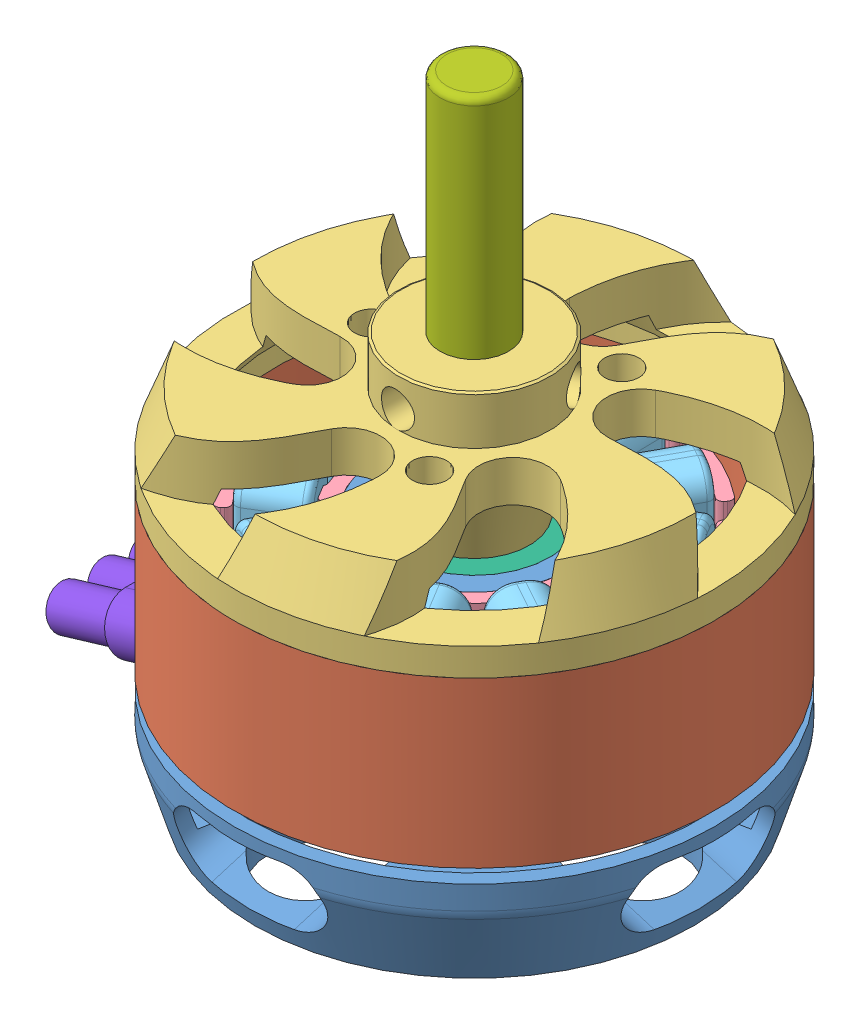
SolidWorks assembly Turnigy Motor.SLDASM, configuration Default (file format 8000). Lengths in mm.
Overall size (45.77 47.68 37.01).
19 component instances, 8 part files, 15 mates.
Components (placement in the parent):
- Bottom Shell-1: Bottom Shell.SLDPRT [Default] at (12.4509 15.3933 26.7626) size (35 18 35)
- Middle Shell-1: Middle Shell.SLDPRT [Default] at (12.4509 23.3933 26.7626) x (-0.059134 0 0.99825) z (-0.99825 0 -0.059134) size (35 12 35)
- Top Shell-1: Top Shell.SLDPRT [Default] at (12.4509 35.3933 26.7626) x (0.999258 0 0.038512) z (-0.038512 0 0.999258) size (35 11.5 35)
- Inner Coil Rack-1: Inner Coil Rack.SLDPRT [Default] at (12.4509 25.3933 26.7626) x (0.999766 0 -0.021621) z (0.021621 0 0.999766) size (27 8 27)
- Coil-1: Coil.SLDPRT [Default] at (12.1274 25.3933 34.9312) x (0.999766 0 -0.021621) z (0.021621 0 0.999766) size (4 11 4.25)
- Coil-13: Coil.SLDPRT [Default] at (8.0864 25.3933 33.675) x (0.876633 0 0.481159) z (-0.481159 0 0.876633) size (4 11 4.25)
- Coil-14: Coil.SLDPRT [Default] at (5.2149 25.3933 30.5667) x (0.518607 0 0.855013) z (-0.855013 0 0.518607) size (4 11 4.25)
- Coil-15: Coil.SLDPRT [Default] at (4.2823 25.3933 26.4391) x (0.021621 0 0.999766) z (-0.999766 0 0.021621) size (4 11 4.25)
- Coil-16: Coil.SLDPRT [Default] at (5.5384 25.3933 22.3982) x (-0.481159 0 0.876633) z (-0.876633 0 -0.481159) size (4 11 4.25)
- Coil-17: Coil.SLDPRT [Default] at (8.6467 25.3933 19.5266) x (-0.855013 0 0.518607) z (-0.518607 0 -0.855013) size (4 11 4.25)
- Coil-18: Coil.SLDPRT [Default] at (12.7743 25.3933 18.594) x (-0.999766 0 0.021621) z (-0.021621 0 -0.999766) size (4 11 4.25)
- Coil-19: Coil.SLDPRT [Default] at (16.8153 25.3933 19.8501) x (-0.876633 0 -0.481159) z (0.481159 0 -0.876633) size (4 11 4.25)
- Coil-20: Coil.SLDPRT [Default] at (19.6868 25.3933 22.9584) x (-0.518607 0 -0.855013) z (0.855013 0 -0.518607) size (4 11 4.25)
- Coil-21: Coil.SLDPRT [Default] at (20.6194 25.3933 27.086) x (-0.021621 0 -0.999766) z (0.999766 0 -0.021621) size (4 11 4.25)
- Coil-22: Coil.SLDPRT [Default] at (19.3633 25.3933 31.127) x (0.481159 0 -0.876633) z (0.876633 0 0.481159) size (4 11 4.25)
- Coil-23: Coil.SLDPRT [Default] at (16.255 25.3933 33.9985) x (0.855013 0 -0.518607) z (0.518607 0 0.855013) size (4 11 4.25)
- Inner Bearing-1: Inner Bearing.SLDPRT [Default] at (12.4509 15.3933 26.7626) size (11 18 11)
- Shaft-1: Shaft.SLDPRT [Default] at (12.4509 13.8933 26.7626) size (5 47.5 5)
- Wires-2: Wires.SLDPRT [Default] at (1.5152 18.792 22.2251) x (0 0 1) z (-0.957822 -0.287361 0) size (10 4 16)
Mates (geometry in assembly coordinates):
- Concentric1: concentric aligned: cylinder of Bottom Shell-1 through (12.4509 22.3933 26.7626) axis (0 -1 0) radius 17.5001; cylinder of Middle Shell-1 through (12.4509 35.3933 26.7626) axis (0 -1 0) radius 17.5
- Distance1: distance = 1 mm anti-aligned: plane of Bottom Shell-1 through (12.4509 22.3933 26.7626) normal (0 1 0); plane of Middle Shell-1 through (12.4509 23.3933 26.7626) normal (0 -1 0)
- Concentric2: concentric aligned: cylinder of Middle Shell-1 through (12.4509 35.3933 26.7626) axis (0 -1 0) radius 17.5; cylinder of Top Shell-1 through (12.4509 37.3933 26.7626) axis (0 -1 0) radius 17.5
- Coincident2: coincident anti-aligned: plane of Middle Shell-1 through (12.4509 35.3933 26.7626) normal (0 1 0); plane of Top Shell-1 through (12.4509 35.3933 26.7626) normal (0 -1 0)
- Coincident3: coincident anti-aligned: plane of Inner Coil Rack-1 through (12.1178 17.6487 34.4885) normal (-0.999766 0 0.021621); plane of Coil-1 through (12.2193 25.3933 39.1802) normal (0.999766 0 -0.021621)
- Coincident4: coincident anti-aligned: plane of Inner Coil Rack-1 through (12.4509 33.3933 26.7626) normal (0 1 0); plane of Coil-1 through (12.2193 33.3933 39.1802) normal (0 -1 0)
- Coincident6: coincident: cylinder of Inner Coil Rack-1 through (12.4509 17.6487 26.7626) axis (0 1 0) radius 12.5; line of Coil-1 through (14.2188 25.6433 39.1369) axis (0 1 0)
- Concentric5: concentric aligned: cylinder of Middle Shell-1 through (12.4509 35.3933 26.7626) axis (0 -1 0) radius 17.5; cylinder of Inner Coil Rack-1 through (12.4509 33.3933 26.7626) axis (0 -1 0) radius 7
- Coincident7: coincident anti-aligned: plane of Top Shell-1 through (12.4509 33.3933 26.7626) normal (0 -1 0); plane of Inner Coil Rack-1 through (12.4509 33.3933 26.7626) normal (0 1 0)
- Concentric6: concentric aligned: cylinder of Bottom Shell-1 through (12.4509 22.3933 26.7626) axis (0 -1 0) radius 5.5; cylinder of Inner Bearing-1 through (12.4509 33.3933 26.7626) axis (0 -1 0) radius 5.5
- Coincident8: coincident aligned: plane of Bottom Shell-1 through (12.4509 15.3933 26.7626) normal (0 -1 0); plane of Inner Bearing-1 through (12.4509 15.3933 26.7626) normal (0 -1 0)
- Concentric7: concentric aligned: cylinder of Inner Bearing-1 through (12.4509 33.3933 26.7626) axis (0 -1 0) radius 2.5; cylinder of Shaft-1 through (12.4509 61.3933 26.7626) axis (0 -1 0) radius 2.5
- Distance3: distance = 16.5 mm aligned: plane of Top Shell-1 through (12.4509 44.8933 26.7626) normal (0 1 0); plane of Shaft-1 through (12.4509 61.3933 26.7626) normal (0 1 0)
- Coincident15: coincident anti-aligned: plane of Bottom Shell-1 through (-3.9227 16.6385 23.7613) normal (-0.287361 0.957822 0); plane of Wires-2 through (-8.8772 15.1521 23.7251) normal (0.287361 -0.957822 0)
- Lock2: lock: unknown of Bottom Shell-1; unknown of Wires-2
